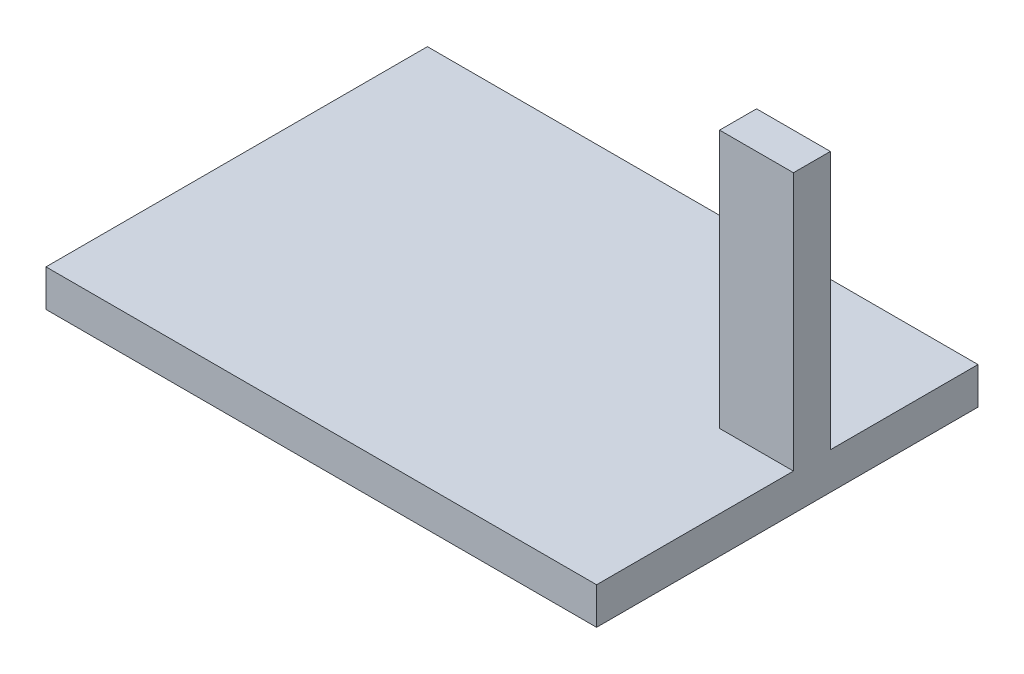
ISO-10303-21;
HEADER;
FILE_DESCRIPTION(('STEP AP214'),'2;1');
FILE_NAME('part.step','',(''),(''),'','','');
FILE_SCHEMA(('AUTOMOTIVE_DESIGN { 1 0 10303 214 1 1 1 1 }'));
ENDSEC;
DATA;
#1=APPLICATION_CONTEXT('core data for automotive mechanical design processes');
#2=APPLICATION_PROTOCOL_DEFINITION('international standard','automotive_design',2000,#1);
#3=PRODUCT_CONTEXT('',#1,'mechanical');
#4=PRODUCT('Part','Part','',(#3));
#5=PRODUCT_RELATED_PRODUCT_CATEGORY('part','',(#4));
#6=PRODUCT_DEFINITION_FORMATION('','',#4);
#7=PRODUCT_DEFINITION_CONTEXT('part definition',#1,'design');
#8=PRODUCT_DEFINITION('design','',#6,#7);
#9=PRODUCT_DEFINITION_SHAPE('','',#8);
#10=(LENGTH_UNIT() NAMED_UNIT(*) SI_UNIT(.MILLI.,.METRE.));
#11=(NAMED_UNIT(*) PLANE_ANGLE_UNIT() SI_UNIT($,.RADIAN.));
#12=(NAMED_UNIT(*) SI_UNIT($,.STERADIAN.) SOLID_ANGLE_UNIT());
#13=UNCERTAINTY_MEASURE_WITH_UNIT(LENGTH_MEASURE(1.E-05),#10,'distance_accuracy_value','');
#14=(GEOMETRIC_REPRESENTATION_CONTEXT(3) GLOBAL_UNCERTAINTY_ASSIGNED_CONTEXT((#13)) GLOBAL_UNIT_ASSIGNED_CONTEXT((#10,
#11,#12)) REPRESENTATION_CONTEXT('',''));
#15=CARTESIAN_POINT('',(0.,0.,0.));
#16=DIRECTION('',(0.,0.,1.));
#17=DIRECTION('',(1.,0.,0.));
#18=AXIS2_PLACEMENT_3D('',#15,#16,#17);
#19=CARTESIAN_POINT('',(0.,304.8,0.));
#20=DIRECTION('',(0.,-1.,0.));
#21=DIRECTION('',(0.,0.,-1.));
#22=AXIS2_PLACEMENT_3D('',#19,#20,#21);
#23=PLANE('',#22);
#24=DIRECTION('',(1.,0.,0.));
#25=VECTOR('',#24,1.);
#26=CARTESIAN_POINT('',(2273.3,304.8,-50.8000000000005));
#27=LINE('',#26,#25);
#28=CARTESIAN_POINT('',(1663.7,304.8,-50.8000000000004));
#29=VERTEX_POINT('',#28);
#30=CARTESIAN_POINT('',(2273.3,304.8,-50.8000000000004));
#31=VERTEX_POINT('',#30);
#32=EDGE_CURVE('E49',#29,#31,#27,.T.);
#33=ORIENTED_EDGE('',*,*,#32,.F.);
#34=DIRECTION('',(0.,0.,1.));
#35=VECTOR('',#34,1.);
#36=CARTESIAN_POINT('',(1663.7,304.8,-50.8000000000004));
#37=LINE('',#36,#35);
#38=CARTESIAN_POINT('',(1663.7,304.8,-355.6));
#39=VERTEX_POINT('',#38);
#40=EDGE_CURVE('E134',#39,#29,#37,.T.);
#41=ORIENTED_EDGE('',*,*,#40,.F.);
#42=DIRECTION('',(-1.,0.,0.));
#43=VECTOR('',#42,1.);
#44=CARTESIAN_POINT('',(2273.3,304.8,-355.6));
#45=LINE('',#44,#43);
#46=CARTESIAN_POINT('',(2273.3,304.8,-355.6));
#47=VERTEX_POINT('',#46);
#48=EDGE_CURVE('E55',#47,#39,#45,.T.);
#49=ORIENTED_EDGE('',*,*,#48,.F.);
#50=DIRECTION('',(0.,0.,-1.));
#51=VECTOR('',#50,1.);
#52=CARTESIAN_POINT('',(2273.3,304.8,1574.8));
#53=LINE('',#52,#51);
#54=CARTESIAN_POINT('',(2273.3,304.8,-1574.8));
#55=VERTEX_POINT('',#54);
#56=EDGE_CURVE('E120',#47,#55,#53,.T.);
#57=ORIENTED_EDGE('',*,*,#56,.T.);
#58=DIRECTION('',(-1.,0.,0.));
#59=VECTOR('',#58,1.);
#60=CARTESIAN_POINT('',(-2273.3,304.8,-1574.8));
#61=LINE('',#60,#59);
#62=CARTESIAN_POINT('',(-2273.3,304.8,-1574.8));
#63=VERTEX_POINT('',#62);
#64=EDGE_CURVE('E144',#55,#63,#61,.T.);
#65=ORIENTED_EDGE('',*,*,#64,.T.);
#66=DIRECTION('',(0.,0.,1.));
#67=VECTOR('',#66,1.);
#68=CARTESIAN_POINT('',(-2273.3,304.8,1574.8));
#69=LINE('',#68,#67);
#70=CARTESIAN_POINT('',(-2273.3,304.8,1574.8));
#71=VERTEX_POINT('',#70);
#72=EDGE_CURVE('E165',#63,#71,#69,.T.);
#73=ORIENTED_EDGE('',*,*,#72,.T.);
#74=DIRECTION('',(1.,0.,0.));
#75=VECTOR('',#74,1.);
#76=CARTESIAN_POINT('',(-2273.3,304.8,1574.8));
#77=LINE('',#76,#75);
#78=CARTESIAN_POINT('',(2273.3,304.8,1574.8));
#79=VERTEX_POINT('',#78);
#80=EDGE_CURVE('E159',#71,#79,#77,.T.);
#81=ORIENTED_EDGE('',*,*,#80,.T.);
#82=EDGE_CURVE('E149',#79,#31,#53,.T.);
#83=ORIENTED_EDGE('',*,*,#82,.T.);
#84=EDGE_LOOP('',(#33,#41,#49,#57,#65,#73,#81,#83));
#85=FACE_BOUND('',#84,.T.);
#86=ADVANCED_FACE('F32',(#85),#23,.F.);
#87=CARTESIAN_POINT('',(2273.3,304.8,1574.8));
#88=DIRECTION('',(-1.,0.,0.));
#89=DIRECTION('',(0.,0.,1.));
#90=AXIS2_PLACEMENT_3D('',#87,#88,#89);
#91=PLANE('',#90);
#92=DIRECTION('',(0.,0.,-1.));
#93=VECTOR('',#92,1.);
#94=CARTESIAN_POINT('',(2273.3,0.,1574.8));
#95=LINE('',#94,#93);
#96=CARTESIAN_POINT('',(2273.3,0.,1574.8));
#97=VERTEX_POINT('',#96);
#98=CARTESIAN_POINT('',(2273.3,0.,-1574.8));
#99=VERTEX_POINT('',#98);
#100=EDGE_CURVE('E121',#97,#99,#95,.T.);
#101=ORIENTED_EDGE('',*,*,#100,.T.);
#102=DIRECTION('',(0.,-1.,0.));
#103=VECTOR('',#102,1.);
#104=CARTESIAN_POINT('',(2273.3,304.8,-1574.8));
#105=LINE('',#104,#103);
#106=EDGE_CURVE('E11',#55,#99,#105,.T.);
#107=ORIENTED_EDGE('',*,*,#106,.F.);
#108=ORIENTED_EDGE('',*,*,#56,.F.);
#109=DIRECTION('',(0.,-1.,0.));
#110=VECTOR('',#109,1.);
#111=CARTESIAN_POINT('',(2273.3,2438.4,-355.6));
#112=LINE('',#111,#110);
#113=CARTESIAN_POINT('',(2273.3,2438.4,-355.6));
#114=VERTEX_POINT('',#113);
#115=EDGE_CURVE('E102',#114,#47,#112,.T.);
#116=ORIENTED_EDGE('',*,*,#115,.F.);
#117=DIRECTION('',(0.,0.,-1.));
#118=VECTOR('',#117,1.);
#119=CARTESIAN_POINT('',(2273.3,2438.4,-50.8000000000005));
#120=LINE('',#119,#118);
#121=CARTESIAN_POINT('',(2273.3,2438.4,-50.8000000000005));
#122=VERTEX_POINT('',#121);
#123=EDGE_CURVE('E108',#122,#114,#120,.T.);
#124=ORIENTED_EDGE('',*,*,#123,.F.);
#125=DIRECTION('',(0.,-1.,0.));
#126=VECTOR('',#125,1.);
#127=CARTESIAN_POINT('',(2273.3,2438.4,-50.8000000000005));
#128=LINE('',#127,#126);
#129=EDGE_CURVE('E135',#122,#31,#128,.T.);
#130=ORIENTED_EDGE('',*,*,#129,.T.);
#131=ORIENTED_EDGE('',*,*,#82,.F.);
#132=DIRECTION('',(0.,-1.,0.));
#133=VECTOR('',#132,1.);
#134=CARTESIAN_POINT('',(2273.3,304.8,1574.8));
#135=LINE('',#134,#133);
#136=EDGE_CURVE('E156',#79,#97,#135,.T.);
#137=ORIENTED_EDGE('',*,*,#136,.T.);
#138=EDGE_LOOP('',(#101,#107,#108,#116,#124,#130,#131,#137));
#139=FACE_BOUND('',#138,.T.);
#140=ADVANCED_FACE('F34',(#139),#91,.F.);
#141=CARTESIAN_POINT('',(-2273.3,304.8,-1574.8));
#142=DIRECTION('',(0.,0.,1.));
#143=DIRECTION('',(1.,0.,0.));
#144=AXIS2_PLACEMENT_3D('',#141,#142,#143);
#145=PLANE('',#144);
#146=DIRECTION('',(-1.,0.,0.));
#147=VECTOR('',#146,1.);
#148=CARTESIAN_POINT('',(-2273.3,0.,-1574.8));
#149=LINE('',#148,#147);
#150=CARTESIAN_POINT('',(-2273.3,0.,-1574.8));
#151=VERTEX_POINT('',#150);
#152=EDGE_CURVE('E123',#99,#151,#149,.T.);
#153=ORIENTED_EDGE('',*,*,#152,.T.);
#154=DIRECTION('',(0.,-1.,0.));
#155=VECTOR('',#154,1.);
#156=CARTESIAN_POINT('',(-2273.3,304.8,-1574.8));
#157=LINE('',#156,#155);
#158=EDGE_CURVE('E41',#63,#151,#157,.T.);
#159=ORIENTED_EDGE('',*,*,#158,.F.);
#160=ORIENTED_EDGE('',*,*,#64,.F.);
#161=ORIENTED_EDGE('',*,*,#106,.T.);
#162=EDGE_LOOP('',(#153,#159,#160,#161));
#163=FACE_BOUND('',#162,.T.);
#164=ADVANCED_FACE('F171',(#163),#145,.F.);
#165=CARTESIAN_POINT('',(-2273.3,304.8,1574.8));
#166=DIRECTION('',(1.,0.,0.));
#167=DIRECTION('',(0.,0.,-1.));
#168=AXIS2_PLACEMENT_3D('',#165,#166,#167);
#169=PLANE('',#168);
#170=DIRECTION('',(0.,0.,1.));
#171=VECTOR('',#170,1.);
#172=CARTESIAN_POINT('',(-2273.3,0.,1574.8));
#173=LINE('',#172,#171);
#174=CARTESIAN_POINT('',(-2273.3,0.,1574.8));
#175=VERTEX_POINT('',#174);
#176=EDGE_CURVE('E162',#151,#175,#173,.T.);
#177=ORIENTED_EDGE('',*,*,#176,.T.);
#178=DIRECTION('',(0.,-1.,0.));
#179=VECTOR('',#178,1.);
#180=CARTESIAN_POINT('',(-2273.3,304.8,1574.8));
#181=LINE('',#180,#179);
#182=EDGE_CURVE('E153',#71,#175,#181,.T.);
#183=ORIENTED_EDGE('',*,*,#182,.F.);
#184=ORIENTED_EDGE('',*,*,#72,.F.);
#185=ORIENTED_EDGE('',*,*,#158,.T.);
#186=EDGE_LOOP('',(#177,#183,#184,#185));
#187=FACE_BOUND('',#186,.T.);
#188=ADVANCED_FACE('F174',(#187),#169,.F.);
#189=CARTESIAN_POINT('',(-2273.3,304.8,1574.8));
#190=DIRECTION('',(0.,0.,-1.));
#191=DIRECTION('',(-1.,0.,0.));
#192=AXIS2_PLACEMENT_3D('',#189,#190,#191);
#193=PLANE('',#192);
#194=DIRECTION('',(1.,0.,0.));
#195=VECTOR('',#194,1.);
#196=CARTESIAN_POINT('',(-2273.3,0.,1574.8));
#197=LINE('',#196,#195);
#198=EDGE_CURVE('E160',#175,#97,#197,.T.);
#199=ORIENTED_EDGE('',*,*,#198,.T.);
#200=ORIENTED_EDGE('',*,*,#136,.F.);
#201=ORIENTED_EDGE('',*,*,#80,.F.);
#202=ORIENTED_EDGE('',*,*,#182,.T.);
#203=EDGE_LOOP('',(#199,#200,#201,#202));
#204=FACE_BOUND('',#203,.T.);
#205=ADVANCED_FACE('F179',(#204),#193,.F.);
#206=CARTESIAN_POINT('',(0.,0.,0.));
#207=DIRECTION('',(0.,-1.,0.));
#208=DIRECTION('',(0.,0.,-1.));
#209=AXIS2_PLACEMENT_3D('',#206,#207,#208);
#210=PLANE('',#209);
#211=ORIENTED_EDGE('',*,*,#100,.F.);
#212=ORIENTED_EDGE('',*,*,#198,.F.);
#213=ORIENTED_EDGE('',*,*,#176,.F.);
#214=ORIENTED_EDGE('',*,*,#152,.F.);
#215=EDGE_LOOP('',(#211,#212,#213,#214));
#216=FACE_BOUND('',#215,.T.);
#217=ADVANCED_FACE('F194',(#216),#210,.T.);
#218=CARTESIAN_POINT('',(2273.3,2438.4,-355.6));
#219=DIRECTION('',(0.,0.,1.));
#220=DIRECTION('',(1.,0.,0.));
#221=AXIS2_PLACEMENT_3D('',#218,#219,#220);
#222=PLANE('',#221);
#223=ORIENTED_EDGE('',*,*,#48,.T.);
#224=DIRECTION('',(0.,-1.,0.));
#225=VECTOR('',#224,1.);
#226=CARTESIAN_POINT('',(1663.7,2438.4,-355.6));
#227=LINE('',#226,#225);
#228=CARTESIAN_POINT('',(1663.7,2438.4,-355.6));
#229=VERTEX_POINT('',#228);
#230=EDGE_CURVE('E104',#229,#39,#227,.T.);
#231=ORIENTED_EDGE('',*,*,#230,.F.);
#232=DIRECTION('',(-1.,0.,0.));
#233=VECTOR('',#232,1.);
#234=CARTESIAN_POINT('',(2273.3,2438.4,-355.6));
#235=LINE('',#234,#233);
#236=EDGE_CURVE('E98',#114,#229,#235,.T.);
#237=ORIENTED_EDGE('',*,*,#236,.F.);
#238=ORIENTED_EDGE('',*,*,#115,.T.);
#239=EDGE_LOOP('',(#223,#231,#237,#238));
#240=FACE_BOUND('',#239,.T.);
#241=ADVANCED_FACE('F100',(#240),#222,.F.);
#242=CARTESIAN_POINT('',(1663.7,2438.4,-50.8000000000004));
#243=DIRECTION('',(1.,0.,0.));
#244=DIRECTION('',(0.,0.,-1.));
#245=AXIS2_PLACEMENT_3D('',#242,#243,#244);
#246=PLANE('',#245);
#247=ORIENTED_EDGE('',*,*,#40,.T.);
#248=DIRECTION('',(0.,-1.,0.));
#249=VECTOR('',#248,1.);
#250=CARTESIAN_POINT('',(1663.7,2438.4,-50.8000000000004));
#251=LINE('',#250,#249);
#252=CARTESIAN_POINT('',(1663.7,2438.4,-50.8000000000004));
#253=VERTEX_POINT('',#252);
#254=EDGE_CURVE('E125',#253,#29,#251,.T.);
#255=ORIENTED_EDGE('',*,*,#254,.F.);
#256=DIRECTION('',(0.,0.,1.));
#257=VECTOR('',#256,1.);
#258=CARTESIAN_POINT('',(1663.7,2438.4,-50.8000000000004));
#259=LINE('',#258,#257);
#260=EDGE_CURVE('E107',#229,#253,#259,.T.);
#261=ORIENTED_EDGE('',*,*,#260,.F.);
#262=ORIENTED_EDGE('',*,*,#230,.T.);
#263=EDGE_LOOP('',(#247,#255,#261,#262));
#264=FACE_BOUND('',#263,.T.);
#265=ADVANCED_FACE('F186',(#264),#246,.F.);
#266=CARTESIAN_POINT('',(2273.3,2438.4,-50.8000000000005));
#267=DIRECTION('',(0.,0.,-1.));
#268=DIRECTION('',(-1.,0.,0.));
#269=AXIS2_PLACEMENT_3D('',#266,#267,#268);
#270=PLANE('',#269);
#271=ORIENTED_EDGE('',*,*,#32,.T.);
#272=ORIENTED_EDGE('',*,*,#129,.F.);
#273=DIRECTION('',(1.,0.,0.));
#274=VECTOR('',#273,1.);
#275=CARTESIAN_POINT('',(2273.3,2438.4,-50.8000000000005));
#276=LINE('',#275,#274);
#277=EDGE_CURVE('E113',#253,#122,#276,.T.);
#278=ORIENTED_EDGE('',*,*,#277,.F.);
#279=ORIENTED_EDGE('',*,*,#254,.T.);
#280=EDGE_LOOP('',(#271,#272,#278,#279));
#281=FACE_BOUND('',#280,.T.);
#282=ADVANCED_FACE('F182',(#281),#270,.F.);
#283=CARTESIAN_POINT('',(0.,2438.4,0.));
#284=DIRECTION('',(0.,1.,0.));
#285=DIRECTION('',(0.,0.,1.));
#286=AXIS2_PLACEMENT_3D('',#283,#284,#285);
#287=PLANE('',#286);
#288=ORIENTED_EDGE('',*,*,#123,.T.);
#289=ORIENTED_EDGE('',*,*,#236,.T.);
#290=ORIENTED_EDGE('',*,*,#260,.T.);
#291=ORIENTED_EDGE('',*,*,#277,.T.);
#292=EDGE_LOOP('',(#288,#289,#290,#291));
#293=FACE_BOUND('',#292,.T.);
#294=ADVANCED_FACE('F111',(#293),#287,.T.);
#295=CLOSED_SHELL('',(#86,#140,#164,#188,#205,#217,#241,#265,#282,#294));
#296=MANIFOLD_SOLID_BREP('B2',#295);
#297=ADVANCED_BREP_SHAPE_REPRESENTATION('',(#18,#296),#14);
#298=SHAPE_DEFINITION_REPRESENTATION(#9,#297);
ENDSEC;
END-ISO-10303-21;
